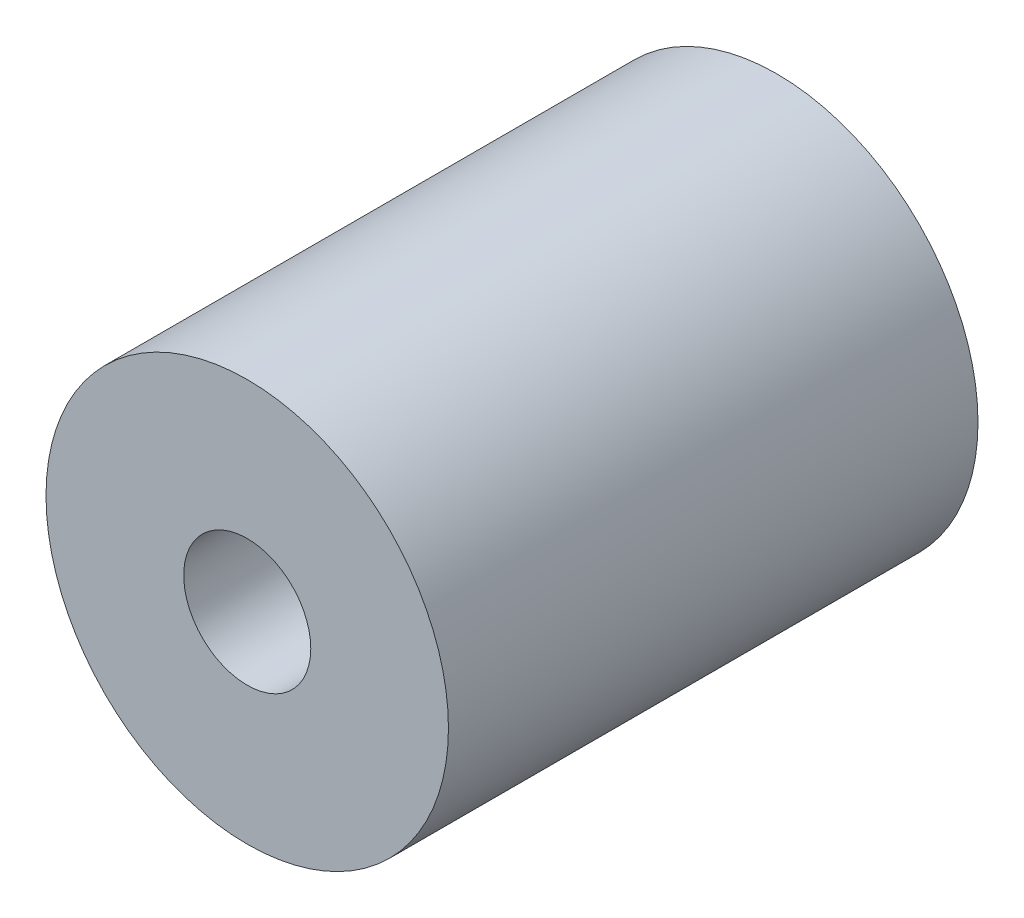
ISO-10303-21;
HEADER;
FILE_DESCRIPTION(('STEP AP214'),'2;1');
FILE_NAME('part.step','',(''),(''),'','','');
FILE_SCHEMA(('AUTOMOTIVE_DESIGN { 1 0 10303 214 1 1 1 1 }'));
ENDSEC;
DATA;
#1=APPLICATION_CONTEXT('core data for automotive mechanical design processes');
#2=APPLICATION_PROTOCOL_DEFINITION('international standard','automotive_design',2000,#1);
#3=PRODUCT_CONTEXT('',#1,'mechanical');
#4=PRODUCT('Part','Part','',(#3));
#5=PRODUCT_RELATED_PRODUCT_CATEGORY('part','',(#4));
#6=PRODUCT_DEFINITION_FORMATION('','',#4);
#7=PRODUCT_DEFINITION_CONTEXT('part definition',#1,'design');
#8=PRODUCT_DEFINITION('design','',#6,#7);
#9=PRODUCT_DEFINITION_SHAPE('','',#8);
#10=(LENGTH_UNIT() NAMED_UNIT(*) SI_UNIT(.MILLI.,.METRE.));
#11=(NAMED_UNIT(*) PLANE_ANGLE_UNIT() SI_UNIT($,.RADIAN.));
#12=(NAMED_UNIT(*) SI_UNIT($,.STERADIAN.) SOLID_ANGLE_UNIT());
#13=UNCERTAINTY_MEASURE_WITH_UNIT(LENGTH_MEASURE(1.E-05),#10,'distance_accuracy_value','');
#14=(GEOMETRIC_REPRESENTATION_CONTEXT(3) GLOBAL_UNCERTAINTY_ASSIGNED_CONTEXT((#13)) GLOBAL_UNIT_ASSIGNED_CONTEXT((#10,
#11,#12)) REPRESENTATION_CONTEXT('',''));
#15=CARTESIAN_POINT('',(0.,0.,0.));
#16=DIRECTION('',(0.,0.,1.));
#17=DIRECTION('',(1.,0.,0.));
#18=AXIS2_PLACEMENT_3D('',#15,#16,#17);
#19=CARTESIAN_POINT('',(0.,0.,25.));
#20=DIRECTION('',(0.,0.,1.));
#21=DIRECTION('',(1.,0.,0.));
#22=AXIS2_PLACEMENT_3D('',#19,#20,#21);
#23=PLANE('',#22);
#24=CARTESIAN_POINT('',(0.,0.,25.));
#25=DIRECTION('',(0.,0.,1.));
#26=DIRECTION('',(1.,0.,0.));
#27=AXIS2_PLACEMENT_3D('',#24,#25,#26);
#28=CIRCLE('',#27,9.5);
#29=CARTESIAN_POINT('',(9.5,0.,25.));
#30=VERTEX_POINT('',#29);
#31=EDGE_CURVE('E10',#30,#30,#28,.T.);
#32=ORIENTED_EDGE('',*,*,#31,.T.);
#33=EDGE_LOOP('',(#32));
#34=FACE_BOUND('',#33,.T.);
#35=CARTESIAN_POINT('',(0.,0.,25.));
#36=DIRECTION('',(0.,0.,1.));
#37=DIRECTION('',(1.,0.,0.));
#38=AXIS2_PLACEMENT_3D('',#35,#36,#37);
#39=CIRCLE('',#38,3.);
#40=CARTESIAN_POINT('',(3.,0.,25.));
#41=VERTEX_POINT('',#40);
#42=EDGE_CURVE('E56',#41,#41,#39,.T.);
#43=ORIENTED_EDGE('',*,*,#42,.F.);
#44=EDGE_LOOP('',(#43));
#45=FACE_BOUND('',#44,.T.);
#46=ADVANCED_FACE('F43',(#34,#45),#23,.T.);
#47=CARTESIAN_POINT('',(0.,0.,0.));
#48=DIRECTION('',(0.,0.,1.));
#49=DIRECTION('',(1.,0.,0.));
#50=AXIS2_PLACEMENT_3D('',#47,#48,#49);
#51=PLANE('',#50);
#52=CARTESIAN_POINT('',(0.,0.,0.));
#53=DIRECTION('',(0.,0.,1.));
#54=DIRECTION('',(1.,0.,0.));
#55=AXIS2_PLACEMENT_3D('',#52,#53,#54);
#56=CIRCLE('',#55,9.5);
#57=CARTESIAN_POINT('',(9.5,0.,0.));
#58=VERTEX_POINT('',#57);
#59=EDGE_CURVE('E47',#58,#58,#56,.T.);
#60=ORIENTED_EDGE('',*,*,#59,.F.);
#61=EDGE_LOOP('',(#60));
#62=FACE_BOUND('',#61,.T.);
#63=CARTESIAN_POINT('',(0.,0.,0.));
#64=DIRECTION('',(0.,0.,1.));
#65=DIRECTION('',(1.,0.,0.));
#66=AXIS2_PLACEMENT_3D('',#63,#64,#65);
#67=CIRCLE('',#66,3.);
#68=CARTESIAN_POINT('',(3.,0.,0.));
#69=VERTEX_POINT('',#68);
#70=EDGE_CURVE('E58',#69,#69,#67,.T.);
#71=ORIENTED_EDGE('',*,*,#70,.T.);
#72=EDGE_LOOP('',(#71));
#73=FACE_BOUND('',#72,.T.);
#74=ADVANCED_FACE('F70',(#62,#73),#51,.F.);
#75=CARTESIAN_POINT('',(0.,0.,25.));
#76=DIRECTION('',(0.,0.,-1.));
#77=DIRECTION('',(-1.,0.,0.));
#78=AXIS2_PLACEMENT_3D('',#75,#76,#77);
#79=CYLINDRICAL_SURFACE('',#78,9.5);
#80=ORIENTED_EDGE('',*,*,#31,.F.);
#81=EDGE_LOOP('',(#80));
#82=FACE_BOUND('',#81,.T.);
#83=ORIENTED_EDGE('',*,*,#59,.T.);
#84=EDGE_LOOP('',(#83));
#85=FACE_BOUND('',#84,.T.);
#86=ADVANCED_FACE('F45',(#82,#85),#79,.T.);
#87=CARTESIAN_POINT('',(0.,0.,25.));
#88=DIRECTION('',(0.,0.,-1.));
#89=DIRECTION('',(-1.,0.,0.));
#90=AXIS2_PLACEMENT_3D('',#87,#88,#89);
#91=CYLINDRICAL_SURFACE('',#90,3.);
#92=ORIENTED_EDGE('',*,*,#42,.T.);
#93=EDGE_LOOP('',(#92));
#94=FACE_BOUND('',#93,.T.);
#95=ORIENTED_EDGE('',*,*,#70,.F.);
#96=EDGE_LOOP('',(#95));
#97=FACE_BOUND('',#96,.T.);
#98=ADVANCED_FACE('F66',(#94,#97),#91,.F.);
#99=CLOSED_SHELL('',(#46,#74,#86,#98));
#100=MANIFOLD_SOLID_BREP('B2',#99);
#101=ADVANCED_BREP_SHAPE_REPRESENTATION('',(#18,#100),#14);
#102=SHAPE_DEFINITION_REPRESENTATION(#9,#101);
ENDSEC;
END-ISO-10303-21;
